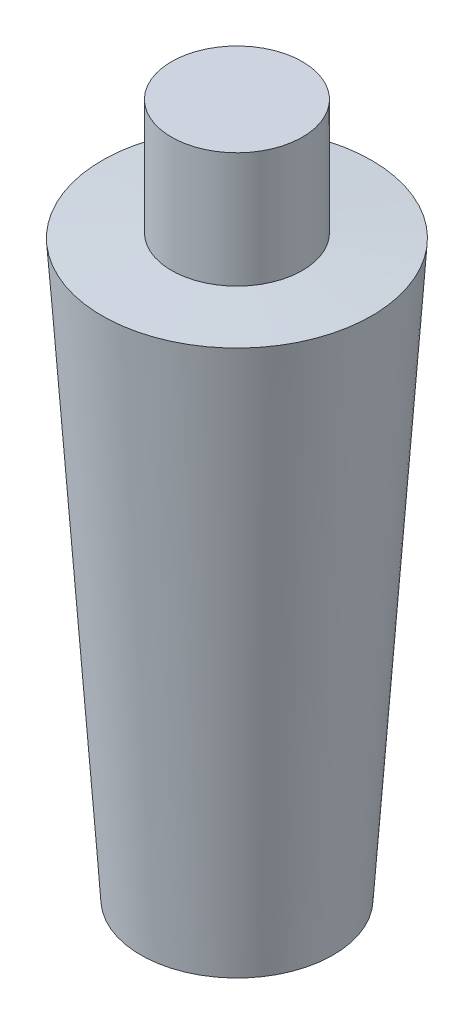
from build123d import *


with BuildPart() as part:
    # Esquisse1 → R_volution1 (revolve)
    with BuildSketch(Plane.XY, mode=Mode.PRIVATE) as r_volution1_sk:
        Polygon((0, 0), (-250, 0), (-350, 1487.902432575), (-170, 1500), (-170, 1800), (0, 1800), align=None)
    revolve(r_volution1_sk.sketch.rotate(Axis((0, 0, 0), (0, 1, 0)), 270), axis=Axis((0, 0, 0), (0, 1, 0)))


solid = part.part
